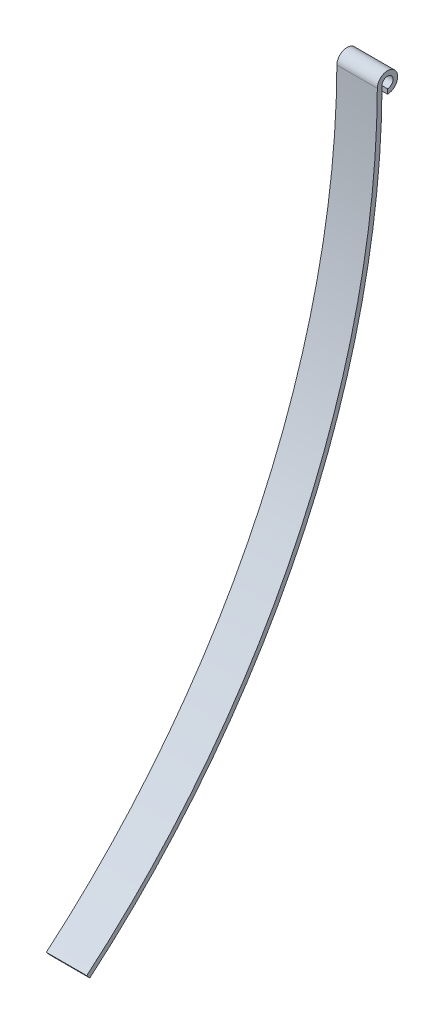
from build123d import *

# Parameters (mm, degrees)
ESQUISSE1_W = 25.8
ESQUISSE1_H = 3


with BuildPart() as part:
    # Balayage2: sweep along a path in Esquisse3
    with BuildLine(Plane(origin=(0, 0, 0), x_dir=(0, 0, -1), z_dir=(1, 0, 0))) as balayage2_path:
        ThreePointArc((0, 0), (4.596194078, 11.096194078), (-6.5, 6.5))
        ThreePointArc((-6.5, 6.5), (-55.497697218, -212.662980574), (-191.891167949, -391.072642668))
    # Esquisse1 → Balayage2 (sweep)
    with BuildSketch(Plane.XY):
        with Locations((12.9, 1.5)):
            Rectangle(ESQUISSE1_W, ESQUISSE1_H)
    sweep(path=balayage2_path.line, transition=Transition.RIGHT)


solid = part.part
